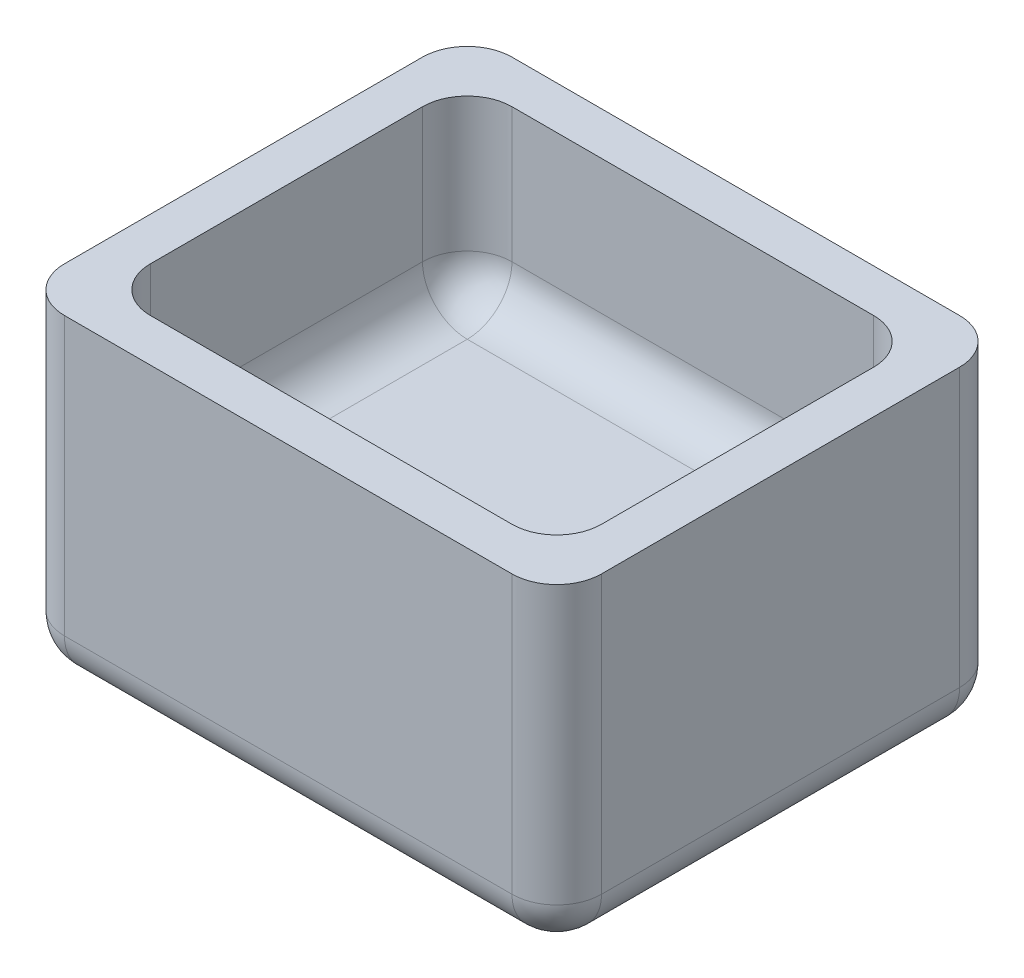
from build123d import *

# Parameters (mm, degrees)
AUFSATZ_LINEAR_AUSTRAGEN1_DEPTH      = 3
AUFSATZ_LINEAR_AUSTRAGEN1_DEPTH_BACK = 15
SKIZZE1_W                            = 30
SKIZZE1_H                            = 25
SKIZZE2_W                            = 25.2
SKIZZE2_H                            = 20.2
SCHNITT_LINEAR_AUSTRAGEN1_DEPTH      = 10
VERRUNDUNG2_R                        = 2.5
VERRUNDUNG4_R                        = 2.5


with BuildPart() as part:
    # Skizze1 → Aufsatz-Linear austragen1 (new, two sides: drawn at the far end of the back side and taken through both)
    with BuildSketch(Plane(origin=(0, 0, 0), x_dir=(1, 0, 0), z_dir=(0, 1, 0)).offset(-AUFSATZ_LINEAR_AUSTRAGEN1_DEPTH_BACK)):
        Rectangle(SKIZZE1_W, SKIZZE1_H)
    extrude(amount=AUFSATZ_LINEAR_AUSTRAGEN1_DEPTH + AUFSATZ_LINEAR_AUSTRAGEN1_DEPTH_BACK)

    # Skizze2 → Schnitt-Linear austragen1 (cut)
    with BuildSketch(Plane(origin=(0, 3, 0), x_dir=(1, 0, 0), z_dir=(0, 1, 0))):
        Rectangle(SKIZZE2_W, SKIZZE2_H)
    extrude(amount=-SCHNITT_LINEAR_AUSTRAGEN1_DEPTH, mode=Mode.SUBTRACT)

    # Verrundung2
    verrundung2_edges = [part.edges().sort_by_distance(p)[0] for p in [
        (0, -7, -10.1),
        (-12.6, -2, -10.1),
        (12.6, -7, 0),
        (12.6, -2, -10.1),
        (0, -7, 10.1),
        (12.6, -2, 10.1),
        (-12.6, -7, 0),
        (-12.6, -2, 10.1),
    ]]
    fillet(verrundung2_edges, radius=VERRUNDUNG2_R)

    # Verrundung4
    verrundung4_edges = [part.edges().sort_by_distance(p)[0] for p in [
        (-15, -15, 0),
        (0, -15, -12.5),
        (15, -15, 0),
        (0, -15, 12.5),
        (-15, -6, -12.5),
        (15, -6, -12.5),
        (15, -6, 12.5),
        (-15, -6, 12.5),
    ]]
    fillet(verrundung4_edges, radius=VERRUNDUNG4_R)


solid = part.part
